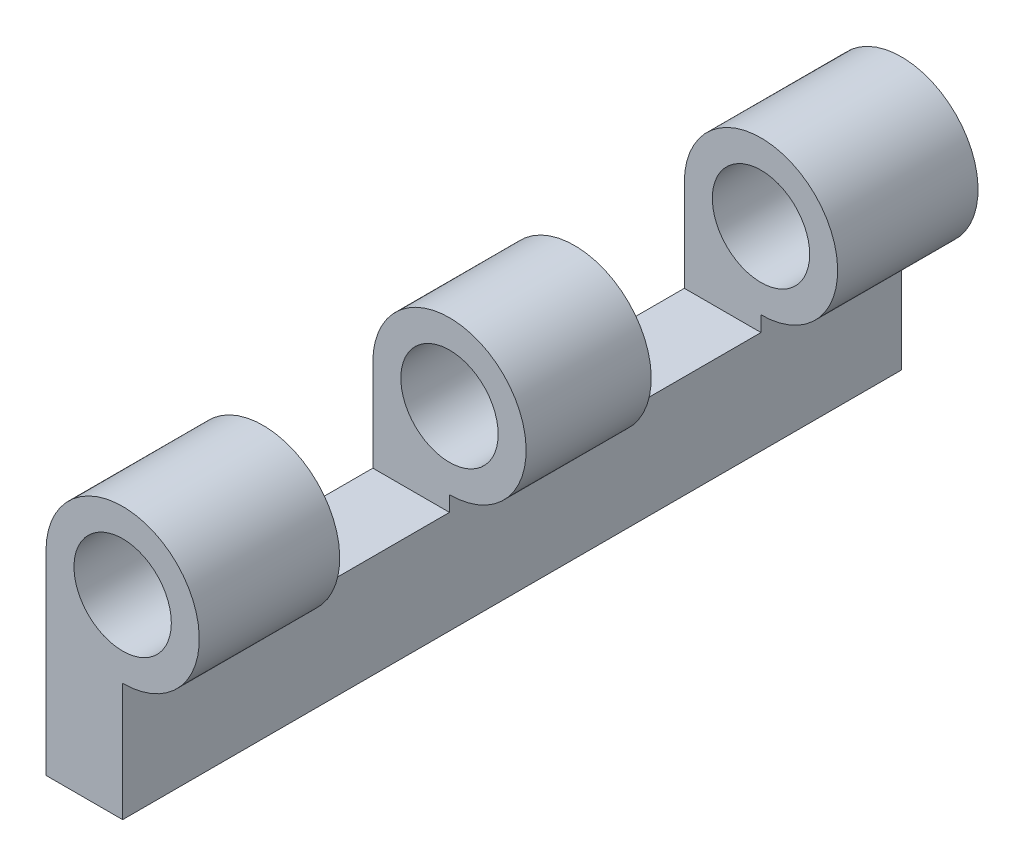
ISO-10303-21;
HEADER;
FILE_DESCRIPTION(('STEP AP214'),'2;1');
FILE_NAME('part.step','',(''),(''),'','','');
FILE_SCHEMA(('AUTOMOTIVE_DESIGN { 1 0 10303 214 1 1 1 1 }'));
ENDSEC;
DATA;
#1=APPLICATION_CONTEXT('core data for automotive mechanical design processes');
#2=APPLICATION_PROTOCOL_DEFINITION('international standard','automotive_design',2000,#1);
#3=PRODUCT_CONTEXT('',#1,'mechanical');
#4=PRODUCT('Part','Part','',(#3));
#5=PRODUCT_RELATED_PRODUCT_CATEGORY('part','',(#4));
#6=PRODUCT_DEFINITION_FORMATION('','',#4);
#7=PRODUCT_DEFINITION_CONTEXT('part definition',#1,'design');
#8=PRODUCT_DEFINITION('design','',#6,#7);
#9=PRODUCT_DEFINITION_SHAPE('','',#8);
#10=(LENGTH_UNIT() NAMED_UNIT(*) SI_UNIT(.MILLI.,.METRE.));
#11=(NAMED_UNIT(*) PLANE_ANGLE_UNIT() SI_UNIT($,.RADIAN.));
#12=(NAMED_UNIT(*) SI_UNIT($,.STERADIAN.) SOLID_ANGLE_UNIT());
#13=UNCERTAINTY_MEASURE_WITH_UNIT(LENGTH_MEASURE(1.E-05),#10,'distance_accuracy_value','');
#14=(GEOMETRIC_REPRESENTATION_CONTEXT(3) GLOBAL_UNCERTAINTY_ASSIGNED_CONTEXT((#13)) GLOBAL_UNIT_ASSIGNED_CONTEXT((#10,
#11,#12)) REPRESENTATION_CONTEXT('',''));
#15=CARTESIAN_POINT('',(0.,0.,0.));
#16=DIRECTION('',(0.,0.,1.));
#17=DIRECTION('',(1.,0.,0.));
#18=AXIS2_PLACEMENT_3D('',#15,#16,#17);
#19=CARTESIAN_POINT('',(5.,12.7,25.4));
#20=DIRECTION('',(0.,0.,-1.));
#21=DIRECTION('',(-1.,0.,0.));
#22=AXIS2_PLACEMENT_3D('',#19,#20,#21);
#23=CYLINDRICAL_SURFACE('',#22,5.);
#24=DIRECTION('',(0.,0.,-1.));
#25=VECTOR('',#24,1.);
#26=CARTESIAN_POINT('',(5.,7.7,25.4));
#27=LINE('',#26,#25);
#28=CARTESIAN_POINT('',(5.,7.7,25.4));
#29=VERTEX_POINT('',#28);
#30=CARTESIAN_POINT('',(5.,7.7,16.24));
#31=VERTEX_POINT('',#30);
#32=EDGE_CURVE('E50',#29,#31,#27,.T.);
#33=ORIENTED_EDGE('',*,*,#32,.T.);
#34=CARTESIAN_POINT('',(5.,12.7,16.24));
#35=DIRECTION('',(0.,0.,1.));
#36=DIRECTION('',(0.,-1.,0.));
#37=AXIS2_PLACEMENT_3D('',#34,#35,#36);
#38=CIRCLE('',#37,5.);
#39=CARTESIAN_POINT('',(0.,12.7,16.24));
#40=VERTEX_POINT('',#39);
#41=EDGE_CURVE('E190',#31,#40,#38,.T.);
#42=ORIENTED_EDGE('',*,*,#41,.T.);
#43=DIRECTION('',(0.,0.,-1.));
#44=VECTOR('',#43,1.);
#45=CARTESIAN_POINT('',(0.,12.7,25.4));
#46=LINE('',#45,#44);
#47=CARTESIAN_POINT('',(0.,12.7,25.4));
#48=VERTEX_POINT('',#47);
#49=EDGE_CURVE('E11',#48,#40,#46,.T.);
#50=ORIENTED_EDGE('',*,*,#49,.F.);
#51=CARTESIAN_POINT('',(5.,12.7,25.4));
#52=DIRECTION('',(0.,0.,1.));
#53=DIRECTION('',(1.,0.,0.));
#54=AXIS2_PLACEMENT_3D('',#51,#52,#53);
#55=CIRCLE('',#54,5.);
#56=EDGE_CURVE('E202',#29,#48,#55,.T.);
#57=ORIENTED_EDGE('',*,*,#56,.F.);
#58=EDGE_LOOP('',(#33,#42,#50,#57));
#59=FACE_BOUND('',#58,.T.);
#60=ADVANCED_FACE('F32',(#59),#23,.T.);
#61=CARTESIAN_POINT('',(0.,12.7,-16.24));
#62=VERTEX_POINT('',#61);
#63=CARTESIAN_POINT('',(0.,12.7,-25.4));
#64=VERTEX_POINT('',#63);
#65=EDGE_CURVE('E43',#62,#64,#46,.T.);
#66=ORIENTED_EDGE('',*,*,#65,.F.);
#67=CARTESIAN_POINT('',(5.,12.7,-16.24));
#68=DIRECTION('',(0.,0.,-1.));
#69=DIRECTION('',(0.,1.,0.));
#70=AXIS2_PLACEMENT_3D('',#67,#68,#69);
#71=CIRCLE('',#70,5.);
#72=CARTESIAN_POINT('',(5.,7.7,-16.24));
#73=VERTEX_POINT('',#72);
#74=EDGE_CURVE('E177',#62,#73,#71,.T.);
#75=ORIENTED_EDGE('',*,*,#74,.T.);
#76=CARTESIAN_POINT('',(5.,7.7,-25.4));
#77=VERTEX_POINT('',#76);
#78=EDGE_CURVE('E210',#73,#77,#27,.T.);
#79=ORIENTED_EDGE('',*,*,#78,.T.);
#80=CARTESIAN_POINT('',(5.,12.7,-25.4));
#81=DIRECTION('',(0.,0.,1.));
#82=DIRECTION('',(1.,0.,0.));
#83=AXIS2_PLACEMENT_3D('',#80,#81,#82);
#84=CIRCLE('',#83,5.);
#85=EDGE_CURVE('E207',#77,#64,#84,.T.);
#86=ORIENTED_EDGE('',*,*,#85,.T.);
#87=EDGE_LOOP('',(#66,#75,#79,#86));
#88=FACE_BOUND('',#87,.T.);
#89=ADVANCED_FACE('F256',(#88),#23,.T.);
#90=CARTESIAN_POINT('',(5.,12.7,-25.4));
#91=DIRECTION('',(0.,0.,1.));
#92=DIRECTION('',(1.,0.,0.));
#93=AXIS2_PLACEMENT_3D('',#90,#91,#92);
#94=CYLINDRICAL_SURFACE('',#93,3.175);
#95=CARTESIAN_POINT('',(5.,12.7,16.24));
#96=DIRECTION('',(0.,0.,1.));
#97=DIRECTION('',(0.,-1.,0.));
#98=AXIS2_PLACEMENT_3D('',#95,#96,#97);
#99=CIRCLE('',#98,3.175);
#100=CARTESIAN_POINT('',(5.,9.525,16.24));
#101=VERTEX_POINT('',#100);
#102=EDGE_CURVE('E36',#101,#101,#99,.F.);
#103=ORIENTED_EDGE('',*,*,#102,.T.);
#104=EDGE_LOOP('',(#103));
#105=FACE_BOUND('',#104,.T.);
#106=CARTESIAN_POINT('',(5.,12.7,25.4));
#107=DIRECTION('',(0.,0.,1.));
#108=DIRECTION('',(1.,0.,0.));
#109=AXIS2_PLACEMENT_3D('',#106,#107,#108);
#110=CIRCLE('',#109,3.175);
#111=CARTESIAN_POINT('',(8.175,12.7,25.4));
#112=VERTEX_POINT('',#111);
#113=EDGE_CURVE('E198',#112,#112,#110,.T.);
#114=ORIENTED_EDGE('',*,*,#113,.T.);
#115=EDGE_LOOP('',(#114));
#116=FACE_BOUND('',#115,.T.);
#117=ADVANCED_FACE('F288',(#105,#116),#94,.F.);
#118=CARTESIAN_POINT('',(5.,12.7,-16.24));
#119=DIRECTION('',(0.,0.,-1.));
#120=DIRECTION('',(0.,1.,0.));
#121=AXIS2_PLACEMENT_3D('',#118,#119,#120);
#122=CIRCLE('',#121,3.175);
#123=CARTESIAN_POINT('',(5.,15.875,-16.24));
#124=VERTEX_POINT('',#123);
#125=EDGE_CURVE('E176',#124,#124,#122,.F.);
#126=ORIENTED_EDGE('',*,*,#125,.T.);
#127=EDGE_LOOP('',(#126));
#128=FACE_BOUND('',#127,.T.);
#129=CARTESIAN_POINT('',(5.,12.7,-25.4));
#130=DIRECTION('',(0.,0.,1.));
#131=DIRECTION('',(1.,0.,0.));
#132=AXIS2_PLACEMENT_3D('',#129,#130,#131);
#133=CIRCLE('',#132,3.175);
#134=CARTESIAN_POINT('',(8.175,12.7,-25.4));
#135=VERTEX_POINT('',#134);
#136=EDGE_CURVE('E199',#135,#135,#133,.T.);
#137=ORIENTED_EDGE('',*,*,#136,.F.);
#138=EDGE_LOOP('',(#137));
#139=FACE_BOUND('',#138,.T.);
#140=ADVANCED_FACE('F306',(#128,#139),#94,.F.);
#141=CARTESIAN_POINT('',(5.,0.,25.4));
#142=DIRECTION('',(-1.,0.,0.));
#143=DIRECTION('',(0.,0.,1.));
#144=AXIS2_PLACEMENT_3D('',#141,#142,#143);
#145=PLANE('',#144);
#146=DIRECTION('',(0.,0.,1.));
#147=VECTOR('',#146,1.);
#148=CARTESIAN_POINT('',(5.,6.7,25.4));
#149=LINE('',#148,#147);
#150=CARTESIAN_POINT('',(5.,6.7,4.07999999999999));
#151=VERTEX_POINT('',#150);
#152=CARTESIAN_POINT('',(5.,6.7,16.24));
#153=VERTEX_POINT('',#152);
#154=EDGE_CURVE('E196',#151,#153,#149,.T.);
#155=ORIENTED_EDGE('',*,*,#154,.T.);
#156=DIRECTION('',(0.,1.,0.));
#157=VECTOR('',#156,1.);
#158=CARTESIAN_POINT('',(5.,0.,16.24));
#159=LINE('',#158,#157);
#160=EDGE_CURVE('E137',#153,#31,#159,.T.);
#161=ORIENTED_EDGE('',*,*,#160,.T.);
#162=ORIENTED_EDGE('',*,*,#32,.F.);
#163=DIRECTION('',(0.,1.,0.));
#164=VECTOR('',#163,1.);
#165=CARTESIAN_POINT('',(5.,0.,25.4));
#166=LINE('',#165,#164);
#167=CARTESIAN_POINT('',(5.,0.,25.4));
#168=VERTEX_POINT('',#167);
#169=EDGE_CURVE('E214',#168,#29,#166,.T.);
#170=ORIENTED_EDGE('',*,*,#169,.F.);
#171=DIRECTION('',(0.,0.,-1.));
#172=VECTOR('',#171,1.);
#173=CARTESIAN_POINT('',(5.,0.,25.4));
#174=LINE('',#173,#172);
#175=CARTESIAN_POINT('',(5.,0.,-25.4));
#176=VERTEX_POINT('',#175);
#177=EDGE_CURVE('E59',#168,#176,#174,.T.);
#178=ORIENTED_EDGE('',*,*,#177,.T.);
#179=DIRECTION('',(0.,1.,0.));
#180=VECTOR('',#179,1.);
#181=CARTESIAN_POINT('',(5.,0.,-25.4));
#182=LINE('',#181,#180);
#183=EDGE_CURVE('E212',#176,#77,#182,.T.);
#184=ORIENTED_EDGE('',*,*,#183,.T.);
#185=ORIENTED_EDGE('',*,*,#78,.F.);
#186=DIRECTION('',(0.,-1.,0.));
#187=VECTOR('',#186,1.);
#188=CARTESIAN_POINT('',(5.,0.,-16.24));
#189=LINE('',#188,#187);
#190=CARTESIAN_POINT('',(5.,6.7,-16.24));
#191=VERTEX_POINT('',#190);
#192=EDGE_CURVE('E180',#73,#191,#189,.T.);
#193=ORIENTED_EDGE('',*,*,#192,.T.);
#194=DIRECTION('',(0.,0.,1.));
#195=VECTOR('',#194,1.);
#196=CARTESIAN_POINT('',(5.,6.69999999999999,25.4));
#197=LINE('',#196,#195);
#198=CARTESIAN_POINT('',(5.,6.7,-4.08000000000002));
#199=VERTEX_POINT('',#198);
#200=EDGE_CURVE('E193',#191,#199,#197,.T.);
#201=ORIENTED_EDGE('',*,*,#200,.T.);
#202=DIRECTION('',(0.,1.,0.));
#203=VECTOR('',#202,1.);
#204=CARTESIAN_POINT('',(5.,0.,-4.08000000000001));
#205=LINE('',#204,#203);
#206=CARTESIAN_POINT('',(5.,7.7,-4.08000000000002));
#207=VERTEX_POINT('',#206);
#208=EDGE_CURVE('E173',#199,#207,#205,.T.);
#209=ORIENTED_EDGE('',*,*,#208,.T.);
#210=CARTESIAN_POINT('',(5.,7.7,4.07999999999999));
#211=VERTEX_POINT('',#210);
#212=EDGE_CURVE('E213',#211,#207,#27,.T.);
#213=ORIENTED_EDGE('',*,*,#212,.F.);
#214=DIRECTION('',(0.,-1.,0.));
#215=VECTOR('',#214,1.);
#216=CARTESIAN_POINT('',(5.,0.,4.07999999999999));
#217=LINE('',#216,#215);
#218=EDGE_CURVE('E187',#211,#151,#217,.T.);
#219=ORIENTED_EDGE('',*,*,#218,.T.);
#220=EDGE_LOOP('',(#155,#161,#162,#170,#178,#184,#185,#193,#201,#209,#213,#219));
#221=FACE_BOUND('',#220,.T.);
#222=ADVANCED_FACE('F34',(#221),#145,.F.);
#223=CARTESIAN_POINT('',(0.,0.,25.4));
#224=DIRECTION('',(-1.,0.,0.));
#225=DIRECTION('',(0.,0.,1.));
#226=AXIS2_PLACEMENT_3D('',#223,#224,#225);
#227=PLANE('',#226);
#228=DIRECTION('',(0.,-1.,0.));
#229=VECTOR('',#228,1.);
#230=CARTESIAN_POINT('',(0.,17.7,16.24));
#231=LINE('',#230,#229);
#232=CARTESIAN_POINT('',(0.,6.7,16.24));
#233=VERTEX_POINT('',#232);
#234=EDGE_CURVE('E136',#40,#233,#231,.T.);
#235=ORIENTED_EDGE('',*,*,#234,.T.);
#236=DIRECTION('',(0.,0.,-1.));
#237=VECTOR('',#236,1.);
#238=CARTESIAN_POINT('',(0.,6.7,16.24));
#239=LINE('',#238,#237);
#240=CARTESIAN_POINT('',(0.,6.7,4.07999999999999));
#241=VERTEX_POINT('',#240);
#242=EDGE_CURVE('E144',#233,#241,#239,.T.);
#243=ORIENTED_EDGE('',*,*,#242,.T.);
#244=DIRECTION('',(0.,1.,0.));
#245=VECTOR('',#244,1.);
#246=CARTESIAN_POINT('',(0.,17.7,4.08000000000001));
#247=LINE('',#246,#245);
#248=CARTESIAN_POINT('',(0.,12.7,4.08));
#249=VERTEX_POINT('',#248);
#250=EDGE_CURVE('E141',#241,#249,#247,.T.);
#251=ORIENTED_EDGE('',*,*,#250,.T.);
#252=CARTESIAN_POINT('',(0.,12.7,-4.08000000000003));
#253=VERTEX_POINT('',#252);
#254=EDGE_CURVE('E41',#249,#253,#46,.T.);
#255=ORIENTED_EDGE('',*,*,#254,.T.);
#256=DIRECTION('',(0.,-1.,0.));
#257=VECTOR('',#256,1.);
#258=CARTESIAN_POINT('',(0.,17.7,-4.08000000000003));
#259=LINE('',#258,#257);
#260=CARTESIAN_POINT('',(0.,6.7,-4.08000000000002));
#261=VERTEX_POINT('',#260);
#262=EDGE_CURVE('E163',#253,#261,#259,.T.);
#263=ORIENTED_EDGE('',*,*,#262,.T.);
#264=DIRECTION('',(0.,0.,-1.));
#265=VECTOR('',#264,1.);
#266=CARTESIAN_POINT('',(0.,6.7,-4.08000000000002));
#267=LINE('',#266,#265);
#268=CARTESIAN_POINT('',(0.,6.7,-16.24));
#269=VERTEX_POINT('',#268);
#270=EDGE_CURVE('E166',#261,#269,#267,.T.);
#271=ORIENTED_EDGE('',*,*,#270,.T.);
#272=DIRECTION('',(0.,1.,0.));
#273=VECTOR('',#272,1.);
#274=CARTESIAN_POINT('',(0.,17.7,-16.24));
#275=LINE('',#274,#273);
#276=EDGE_CURVE('E160',#269,#62,#275,.T.);
#277=ORIENTED_EDGE('',*,*,#276,.T.);
#278=ORIENTED_EDGE('',*,*,#65,.T.);
#279=DIRECTION('',(0.,1.,0.));
#280=VECTOR('',#279,1.);
#281=CARTESIAN_POINT('',(0.,0.,-25.4));
#282=LINE('',#281,#280);
#283=CARTESIAN_POINT('',(0.,0.,-25.4));
#284=VERTEX_POINT('',#283);
#285=EDGE_CURVE('E221',#284,#64,#282,.T.);
#286=ORIENTED_EDGE('',*,*,#285,.F.);
#287=DIRECTION('',(0.,0.,-1.));
#288=VECTOR('',#287,1.);
#289=CARTESIAN_POINT('',(0.,0.,25.4));
#290=LINE('',#289,#288);
#291=CARTESIAN_POINT('',(0.,0.,25.4));
#292=VERTEX_POINT('',#291);
#293=EDGE_CURVE('E227',#292,#284,#290,.T.);
#294=ORIENTED_EDGE('',*,*,#293,.F.);
#295=DIRECTION('',(0.,1.,0.));
#296=VECTOR('',#295,1.);
#297=CARTESIAN_POINT('',(0.,0.,25.4));
#298=LINE('',#297,#296);
#299=EDGE_CURVE('E77',#292,#48,#298,.T.);
#300=ORIENTED_EDGE('',*,*,#299,.T.);
#301=ORIENTED_EDGE('',*,*,#49,.T.);
#302=EDGE_LOOP('',(#235,#243,#251,#255,#263,#271,#277,#278,#286,#294,#300,#301));
#303=FACE_BOUND('',#302,.T.);
#304=ADVANCED_FACE('F150',(#303),#227,.T.);
#305=CARTESIAN_POINT('',(5.,0.,25.4));
#306=DIRECTION('',(0.,-1.,0.));
#307=DIRECTION('',(0.,0.,-1.));
#308=AXIS2_PLACEMENT_3D('',#305,#306,#307);
#309=PLANE('',#308);
#310=DIRECTION('',(-1.,0.,0.));
#311=VECTOR('',#310,1.);
#312=CARTESIAN_POINT('',(5.,0.,-25.4));
#313=LINE('',#312,#311);
#314=EDGE_CURVE('E216',#176,#284,#313,.T.);
#315=ORIENTED_EDGE('',*,*,#314,.F.);
#316=ORIENTED_EDGE('',*,*,#177,.F.);
#317=DIRECTION('',(-1.,0.,0.));
#318=VECTOR('',#317,1.);
#319=CARTESIAN_POINT('',(5.,0.,25.4));
#320=LINE('',#319,#318);
#321=EDGE_CURVE('E218',#168,#292,#320,.T.);
#322=ORIENTED_EDGE('',*,*,#321,.T.);
#323=ORIENTED_EDGE('',*,*,#293,.T.);
#324=EDGE_LOOP('',(#315,#316,#322,#323));
#325=FACE_BOUND('',#324,.T.);
#326=ADVANCED_FACE('F258',(#325),#309,.T.);
#327=CARTESIAN_POINT('',(0.,0.,25.4));
#328=DIRECTION('',(0.,0.,-1.));
#329=DIRECTION('',(-1.,0.,0.));
#330=AXIS2_PLACEMENT_3D('',#327,#328,#329);
#331=PLANE('',#330);
#332=ORIENTED_EDGE('',*,*,#113,.F.);
#333=EDGE_LOOP('',(#332));
#334=FACE_BOUND('',#333,.T.);
#335=ORIENTED_EDGE('',*,*,#169,.T.);
#336=ORIENTED_EDGE('',*,*,#56,.T.);
#337=ORIENTED_EDGE('',*,*,#299,.F.);
#338=ORIENTED_EDGE('',*,*,#321,.F.);
#339=EDGE_LOOP('',(#335,#336,#337,#338));
#340=FACE_BOUND('',#339,.T.);
#341=ADVANCED_FACE('F261',(#334,#340),#331,.F.);
#342=CARTESIAN_POINT('',(0.,0.,-25.4));
#343=DIRECTION('',(0.,0.,-1.));
#344=DIRECTION('',(-1.,0.,0.));
#345=AXIS2_PLACEMENT_3D('',#342,#343,#344);
#346=PLANE('',#345);
#347=ORIENTED_EDGE('',*,*,#136,.T.);
#348=EDGE_LOOP('',(#347));
#349=FACE_BOUND('',#348,.T.);
#350=ORIENTED_EDGE('',*,*,#285,.T.);
#351=ORIENTED_EDGE('',*,*,#85,.F.);
#352=ORIENTED_EDGE('',*,*,#183,.F.);
#353=ORIENTED_EDGE('',*,*,#314,.T.);
#354=EDGE_LOOP('',(#350,#351,#352,#353));
#355=FACE_BOUND('',#354,.T.);
#356=ADVANCED_FACE('F255',(#349,#355),#346,.T.);
#357=ORIENTED_EDGE('',*,*,#254,.F.);
#358=CARTESIAN_POINT('',(5.,12.7,4.08));
#359=DIRECTION('',(0.,0.,-1.));
#360=DIRECTION('',(0.,1.,0.));
#361=AXIS2_PLACEMENT_3D('',#358,#359,#360);
#362=CIRCLE('',#361,5.);
#363=EDGE_CURVE('E184',#249,#211,#362,.T.);
#364=ORIENTED_EDGE('',*,*,#363,.T.);
#365=ORIENTED_EDGE('',*,*,#212,.T.);
#366=CARTESIAN_POINT('',(5.,12.7,-4.08000000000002));
#367=DIRECTION('',(0.,0.,1.));
#368=DIRECTION('',(0.,-1.,0.));
#369=AXIS2_PLACEMENT_3D('',#366,#367,#368);
#370=CIRCLE('',#369,5.);
#371=EDGE_CURVE('E171',#207,#253,#370,.T.);
#372=ORIENTED_EDGE('',*,*,#371,.T.);
#373=EDGE_LOOP('',(#357,#364,#365,#372));
#374=FACE_BOUND('',#373,.T.);
#375=ADVANCED_FACE('F247',(#374),#23,.T.);
#376=CARTESIAN_POINT('',(0.,6.7,-4.08000000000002));
#377=DIRECTION('',(0.,-1.,0.));
#378=DIRECTION('',(0.,0.,-1.));
#379=AXIS2_PLACEMENT_3D('',#376,#377,#378);
#380=PLANE('',#379);
#381=DIRECTION('',(1.,0.,0.));
#382=VECTOR('',#381,1.);
#383=CARTESIAN_POINT('',(0.,6.7,-16.24));
#384=LINE('',#383,#382);
#385=EDGE_CURVE('E151',#269,#191,#384,.T.);
#386=ORIENTED_EDGE('',*,*,#385,.F.);
#387=ORIENTED_EDGE('',*,*,#270,.F.);
#388=DIRECTION('',(1.,0.,0.));
#389=VECTOR('',#388,1.);
#390=CARTESIAN_POINT('',(0.,6.7,-4.08000000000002));
#391=LINE('',#390,#389);
#392=EDGE_CURVE('E154',#261,#199,#391,.T.);
#393=ORIENTED_EDGE('',*,*,#392,.T.);
#394=ORIENTED_EDGE('',*,*,#200,.F.);
#395=EDGE_LOOP('',(#386,#387,#393,#394));
#396=FACE_BOUND('',#395,.T.);
#397=ADVANCED_FACE('F268',(#396),#380,.F.);
#398=CARTESIAN_POINT('',(0.,17.7,-16.24));
#399=DIRECTION('',(0.,0.,-1.));
#400=DIRECTION('',(0.,1.,0.));
#401=AXIS2_PLACEMENT_3D('',#398,#399,#400);
#402=PLANE('',#401);
#403=ORIENTED_EDGE('',*,*,#125,.F.);
#404=EDGE_LOOP('',(#403));
#405=FACE_BOUND('',#404,.T.);
#406=ORIENTED_EDGE('',*,*,#74,.F.);
#407=ORIENTED_EDGE('',*,*,#276,.F.);
#408=ORIENTED_EDGE('',*,*,#385,.T.);
#409=ORIENTED_EDGE('',*,*,#192,.F.);
#410=EDGE_LOOP('',(#406,#407,#408,#409));
#411=FACE_BOUND('',#410,.T.);
#412=ADVANCED_FACE('F270',(#405,#411),#402,.F.);
#413=CARTESIAN_POINT('',(0.,17.7,-4.08000000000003));
#414=DIRECTION('',(0.,0.,1.));
#415=DIRECTION('',(0.,-1.,0.));
#416=AXIS2_PLACEMENT_3D('',#413,#414,#415);
#417=PLANE('',#416);
#418=CARTESIAN_POINT('',(5.,12.7,-4.08000000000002));
#419=DIRECTION('',(0.,0.,1.));
#420=DIRECTION('',(0.,-1.,0.));
#421=AXIS2_PLACEMENT_3D('',#418,#419,#420);
#422=CIRCLE('',#421,3.175);
#423=CARTESIAN_POINT('',(8.175,12.7,-4.08000000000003));
#424=VERTEX_POINT('',#423);
#425=EDGE_CURVE('E158',#424,#424,#422,.F.);
#426=ORIENTED_EDGE('',*,*,#425,.F.);
#427=EDGE_LOOP('',(#426));
#428=FACE_BOUND('',#427,.T.);
#429=ORIENTED_EDGE('',*,*,#371,.F.);
#430=ORIENTED_EDGE('',*,*,#208,.F.);
#431=ORIENTED_EDGE('',*,*,#392,.F.);
#432=ORIENTED_EDGE('',*,*,#262,.F.);
#433=EDGE_LOOP('',(#429,#430,#431,#432));
#434=FACE_BOUND('',#433,.T.);
#435=ADVANCED_FACE('F265',(#428,#434),#417,.F.);
#436=CARTESIAN_POINT('',(0.,6.7,16.24));
#437=DIRECTION('',(0.,-1.,0.));
#438=DIRECTION('',(0.,0.,-1.));
#439=AXIS2_PLACEMENT_3D('',#436,#437,#438);
#440=PLANE('',#439);
#441=DIRECTION('',(1.,0.,0.));
#442=VECTOR('',#441,1.);
#443=CARTESIAN_POINT('',(0.,6.7,4.07999999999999));
#444=LINE('',#443,#442);
#445=EDGE_CURVE('E140',#241,#151,#444,.T.);
#446=ORIENTED_EDGE('',*,*,#445,.F.);
#447=ORIENTED_EDGE('',*,*,#242,.F.);
#448=DIRECTION('',(1.,0.,0.));
#449=VECTOR('',#448,1.);
#450=CARTESIAN_POINT('',(0.,6.7,16.24));
#451=LINE('',#450,#449);
#452=EDGE_CURVE('E132',#233,#153,#451,.T.);
#453=ORIENTED_EDGE('',*,*,#452,.T.);
#454=ORIENTED_EDGE('',*,*,#154,.F.);
#455=EDGE_LOOP('',(#446,#447,#453,#454));
#456=FACE_BOUND('',#455,.T.);
#457=ADVANCED_FACE('F145',(#456),#440,.F.);
#458=CARTESIAN_POINT('',(0.,17.7,16.24));
#459=DIRECTION('',(0.,0.,1.));
#460=DIRECTION('',(0.,-1.,0.));
#461=AXIS2_PLACEMENT_3D('',#458,#459,#460);
#462=PLANE('',#461);
#463=ORIENTED_EDGE('',*,*,#102,.F.);
#464=EDGE_LOOP('',(#463));
#465=FACE_BOUND('',#464,.T.);
#466=ORIENTED_EDGE('',*,*,#41,.F.);
#467=ORIENTED_EDGE('',*,*,#160,.F.);
#468=ORIENTED_EDGE('',*,*,#452,.F.);
#469=ORIENTED_EDGE('',*,*,#234,.F.);
#470=EDGE_LOOP('',(#466,#467,#468,#469));
#471=FACE_BOUND('',#470,.T.);
#472=ADVANCED_FACE('F134',(#465,#471),#462,.F.);
#473=CARTESIAN_POINT('',(0.,17.7,4.08000000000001));
#474=DIRECTION('',(0.,0.,-1.));
#475=DIRECTION('',(0.,1.,0.));
#476=AXIS2_PLACEMENT_3D('',#473,#474,#475);
#477=PLANE('',#476);
#478=CARTESIAN_POINT('',(5.,12.7,4.08));
#479=DIRECTION('',(0.,0.,-1.));
#480=DIRECTION('',(0.,1.,0.));
#481=AXIS2_PLACEMENT_3D('',#478,#479,#480);
#482=CIRCLE('',#481,3.175);
#483=CARTESIAN_POINT('',(8.175,12.7,4.08));
#484=VERTEX_POINT('',#483);
#485=EDGE_CURVE('E183',#484,#484,#482,.F.);
#486=ORIENTED_EDGE('',*,*,#485,.F.);
#487=EDGE_LOOP('',(#486));
#488=FACE_BOUND('',#487,.T.);
#489=ORIENTED_EDGE('',*,*,#363,.F.);
#490=ORIENTED_EDGE('',*,*,#250,.F.);
#491=ORIENTED_EDGE('',*,*,#445,.T.);
#492=ORIENTED_EDGE('',*,*,#218,.F.);
#493=EDGE_LOOP('',(#489,#490,#491,#492));
#494=FACE_BOUND('',#493,.T.);
#495=ADVANCED_FACE('F238',(#488,#494),#477,.F.);
#496=CARTESIAN_POINT('',(8.175,12.7,4.08));
#497=CARTESIAN_POINT('',(8.175,12.7,3.995));
#498=CARTESIAN_POINT('',(8.175,12.7,3.91));
#499=CARTESIAN_POINT('',(8.175,12.7,3.74));
#500=CARTESIAN_POINT('',(8.175,12.7,3.655));
#501=CARTESIAN_POINT('',(8.175,12.7,3.485));
#502=CARTESIAN_POINT('',(8.175,12.7,3.4));
#503=CARTESIAN_POINT('',(8.175,12.7,3.23));
#504=CARTESIAN_POINT('',(8.175,12.7,3.145));
#505=CARTESIAN_POINT('',(8.175,12.7,2.975));
#506=CARTESIAN_POINT('',(8.175,12.7,2.89));
#507=CARTESIAN_POINT('',(8.175,12.7,2.72));
#508=CARTESIAN_POINT('',(8.175,12.7,2.635));
#509=CARTESIAN_POINT('',(8.175,12.7,2.465));
#510=CARTESIAN_POINT('',(8.175,12.7,2.38));
#511=CARTESIAN_POINT('',(8.175,12.7,2.20999999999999));
#512=CARTESIAN_POINT('',(8.175,12.7,2.12499999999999));
#513=CARTESIAN_POINT('',(8.175,12.7,1.95499999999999));
#514=CARTESIAN_POINT('',(8.175,12.7,1.86999999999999));
#515=CARTESIAN_POINT('',(8.175,12.7,1.69999999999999));
#516=CARTESIAN_POINT('',(8.175,12.7,1.61499999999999));
#517=CARTESIAN_POINT('',(8.175,12.7,1.44499999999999));
#518=CARTESIAN_POINT('',(8.175,12.7,1.35999999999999));
#519=CARTESIAN_POINT('',(8.175,12.7,1.18999999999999));
#520=CARTESIAN_POINT('',(8.175,12.7,1.10499999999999));
#521=CARTESIAN_POINT('',(8.175,12.7,0.934999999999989));
#522=CARTESIAN_POINT('',(8.175,12.7,0.849999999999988));
#523=CARTESIAN_POINT('',(8.175,12.7,0.679999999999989));
#524=CARTESIAN_POINT('',(8.175,12.7,0.594999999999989));
#525=CARTESIAN_POINT('',(8.175,12.7,0.424999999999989));
#526=CARTESIAN_POINT('',(8.175,12.7,0.339999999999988));
#527=CARTESIAN_POINT('',(8.175,12.7,0.169999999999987));
#528=CARTESIAN_POINT('',(8.175,12.7,0.0849999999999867));
#529=CARTESIAN_POINT('',(8.175,12.7,-0.0850000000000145));
#530=CARTESIAN_POINT('',(8.175,12.7,-0.170000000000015));
#531=CARTESIAN_POINT('',(8.175,12.7,-0.340000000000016));
#532=CARTESIAN_POINT('',(8.175,12.7,-0.425000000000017));
#533=CARTESIAN_POINT('',(8.175,12.7,-0.595000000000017));
#534=CARTESIAN_POINT('',(8.175,12.7,-0.680000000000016));
#535=CARTESIAN_POINT('',(8.175,12.7,-0.850000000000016));
#536=CARTESIAN_POINT('',(8.175,12.7,-0.935000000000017));
#537=CARTESIAN_POINT('',(8.175,12.7,-1.10500000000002));
#538=CARTESIAN_POINT('',(8.175,12.7,-1.19000000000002));
#539=CARTESIAN_POINT('',(8.175,12.7,-1.36000000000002));
#540=CARTESIAN_POINT('',(8.175,12.7,-1.44500000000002));
#541=CARTESIAN_POINT('',(8.175,12.7,-1.61500000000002));
#542=CARTESIAN_POINT('',(8.175,12.7,-1.70000000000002));
#543=CARTESIAN_POINT('',(8.175,12.7,-1.87000000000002));
#544=CARTESIAN_POINT('',(8.175,12.7,-1.95500000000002));
#545=CARTESIAN_POINT('',(8.175,12.7,-2.12500000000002));
#546=CARTESIAN_POINT('',(8.175,12.7,-2.21000000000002));
#547=CARTESIAN_POINT('',(8.175,12.7,-2.38000000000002));
#548=CARTESIAN_POINT('',(8.175,12.7,-2.46500000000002));
#549=CARTESIAN_POINT('',(8.175,12.7,-2.63500000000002));
#550=CARTESIAN_POINT('',(8.175,12.7,-2.72000000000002));
#551=CARTESIAN_POINT('',(8.175,12.7,-2.89000000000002));
#552=CARTESIAN_POINT('',(8.175,12.7,-2.97500000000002));
#553=CARTESIAN_POINT('',(8.175,12.7,-3.14500000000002));
#554=CARTESIAN_POINT('',(8.175,12.7,-3.23000000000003));
#555=CARTESIAN_POINT('',(8.175,12.7,-3.40000000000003));
#556=CARTESIAN_POINT('',(8.175,12.7,-3.48500000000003));
#557=CARTESIAN_POINT('',(8.175,12.7,-3.65500000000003));
#558=CARTESIAN_POINT('',(8.175,12.7,-3.74000000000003));
#559=CARTESIAN_POINT('',(8.175,12.7,-3.91000000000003));
#560=CARTESIAN_POINT('',(8.175,12.7,-3.99500000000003));
#561=CARTESIAN_POINT('',(8.175,12.7,-4.08000000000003));
#562=B_SPLINE_CURVE_WITH_KNOTS('',3,(#496,#497,#498,#499,#500,#501,#502,#503,#504,#505,#506,
#507,#508,#509,#510,#511,#512,#513,#514,#515,#516,#517,#518,#519,#520,#521,#522,#523,#524,#525,
#526,#527,#528,#529,#530,#531,#532,#533,#534,#535,#536,#537,#538,#539,#540,#541,#542,#543,#544,
#545,#546,#547,#548,#549,#550,#551,#552,#553,#554,#555,#556,#557,#558,#559,#560,#561),
.UNSPECIFIED.,.F.,.F.,(4,2,2,2,2,2,2,2,2,2,2,2,2,2,2,2,2,2,2,2,2,2,2,2,2,2,2,2,2,2,2,2,4),(0.,
0.255000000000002,0.510000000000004,0.765000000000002,1.02,1.27500000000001,1.53,
1.78500000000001,2.04000000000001,2.29500000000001,2.55000000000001,2.80500000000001,
3.06000000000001,3.31500000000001,3.57000000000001,3.82500000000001,4.08000000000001,
4.33500000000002,4.59000000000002,4.84500000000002,5.10000000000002,5.35500000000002,
5.61000000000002,5.86500000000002,6.12000000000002,6.37500000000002,6.63000000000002,
6.88500000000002,7.14000000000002,7.39500000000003,7.65000000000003,7.90500000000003,
8.16000000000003),.UNSPECIFIED.);
#563=EDGE_CURVE('BSEAM235',#484,#424,#562,.T.);
#564=ORIENTED_EDGE('',*,*,#485,.T.);
#565=ORIENTED_EDGE('',*,*,#425,.T.);
#566=ORIENTED_EDGE('',*,*,#563,.T.);
#567=ORIENTED_EDGE('',*,*,#563,.F.);
#568=EDGE_LOOP('',(#564,#566,#565,#567));
#569=FACE_BOUND('',#568,.T.);
#570=ADVANCED_FACE('F235',(#569),#94,.F.);
#571=CLOSED_SHELL('',(#60,#89,#117,#140,#222,#304,#326,#341,#356,#375,#397,#412,#435,#457,#472,
#495,#570));
#572=MANIFOLD_SOLID_BREP('B2',#571);
#573=ADVANCED_BREP_SHAPE_REPRESENTATION('',(#18,#572),#14);
#574=SHAPE_DEFINITION_REPRESENTATION(#9,#573);
ENDSEC;
END-ISO-10303-21;
